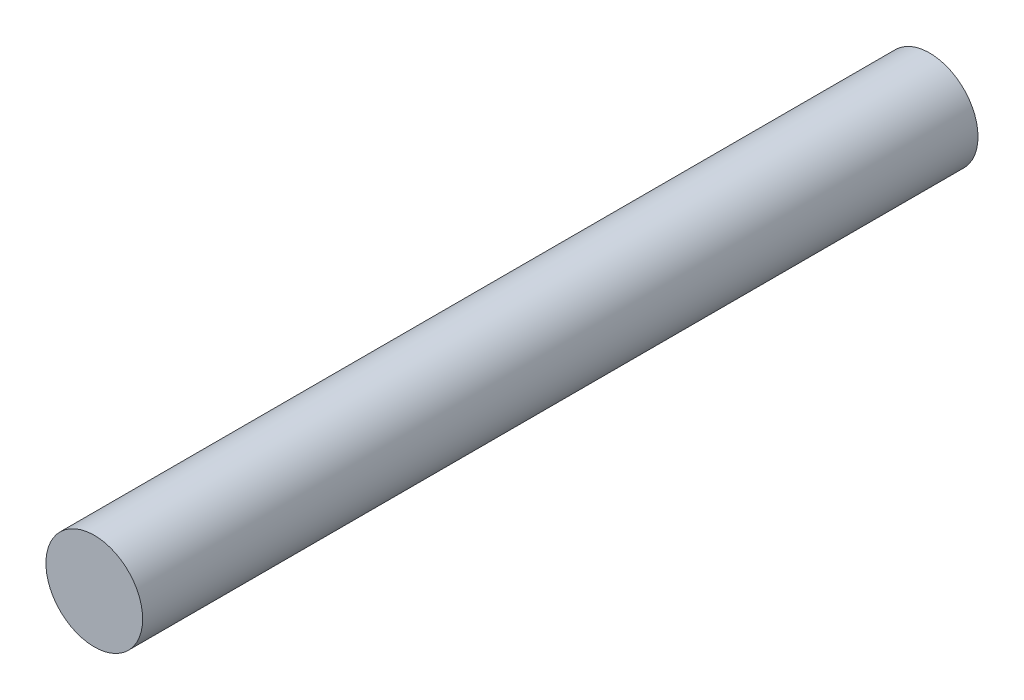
from build123d import *

# Parameters (mm, degrees)
SKETCH1_R           = 1.1
BOSS_EXTRUDE1_DEPTH = 19


with BuildPart() as part:
    # Sketch1 → Boss-Extrude1 (new body)
    with BuildSketch(Plane.XY):
        Circle(SKETCH1_R)
    extrude(amount=BOSS_EXTRUDE1_DEPTH)


solid = part.part
